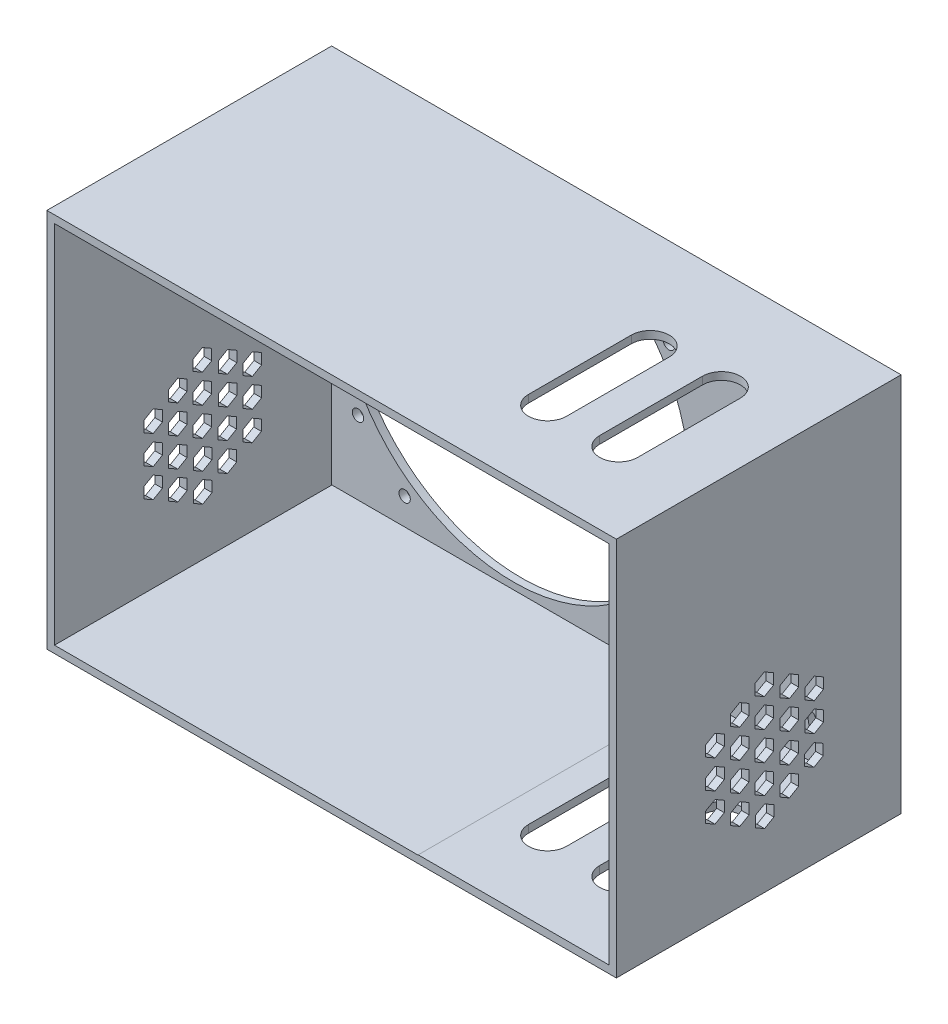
from build123d import *

# Parameters (mm, degrees)
CROQUIS2_W              = 100.387312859
CROQUIS2_H              = 192.201
CROQUIS2_R              = 4.054087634
CROQUIS2_W_2            = 191.612587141
CROQUIS2_R_2            = 3
CROQUIS2_R_3            = 92.5
SALIENTE_EXTRUIR1_DEPTH = 4
CROQUIS2_9_W            = 299.9999
CROQUIS2_9_H            = 200.201
SALIENTE_EXTRUIR3_DEPTH = 150
CORTAR_EXTRUIR1_DEPTH   = 543.825048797
CORTAR_EXTRUIR2_DEPTH   = 399.424962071


with BuildPart() as part:
    # Croquis2 → Saliente-Extruir1 (new body)
    # profile 1 of 2: a face of its own
    with BuildSketch(Plane.XY):
        with Locations((255.906343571, 326.7005)):
            Rectangle(CROQUIS2_W, CROQUIS2_H)
        with BuildLine():
            ThreePointArc((294.90639357, 251.620721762), (296.90639357, 253.620721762), (298.90639357, 251.620721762))
            ThreePointArc((298.90639357, 251.620721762), (281.90639357, 234.620721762), (264.90639357, 251.620721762))
            ThreePointArc((264.90639357, 251.620721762), (266.90639357, 253.620721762), (268.90639357, 251.620721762))
            ThreePointArc((268.90639357, 251.620721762), (281.90639357, 238.620721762), (294.90639357, 251.620721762))
        make_face(mode=Mode.SUBTRACT)
        with Locations((281.90639357, 251.620721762)):
            Circle(CROQUIS2_R, mode=Mode.SUBTRACT)
        with Locations((281.90639357, 326.620721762)):
            Circle(CROQUIS2_R, mode=Mode.SUBTRACT)
        with Locations((281.90639357, 401.620721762)):
            Circle(CROQUIS2_R, mode=Mode.SUBTRACT)
        with BuildLine():
            ThreePointArc((264.90639357, 401.620721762), (281.90639357, 418.620721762), (298.90639357, 401.620721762))
            ThreePointArc((298.90639357, 401.620721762), (298.320607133, 400.206508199), (296.90639357, 399.620721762))
            ThreePointArc((296.90639357, 399.620721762), (295.492180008, 400.206508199), (294.90639357, 401.620721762))
            ThreePointArc((294.90639357, 401.620721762), (281.90639357, 414.620721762), (268.90639357, 401.620721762))
            ThreePointArc((268.90639357, 401.620721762), (268.320607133, 400.206508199), (266.90639357, 399.620721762))
            ThreePointArc((266.90639357, 399.620721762), (265.492180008, 400.206508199), (264.90639357, 401.620721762))
        make_face(mode=Mode.SUBTRACT)
    # profile 2 of 2: a face of its own
    with BuildSketch(Plane.XY):
        with Locations((109.906393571, 326.7005)):
            Rectangle(CROQUIS2_W_2, CROQUIS2_H)
        with Locations((52.548749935, 244.705517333)):
            Circle(CROQUIS2_R_2, mode=Mode.SUBTRACT)
        with Locations((27.991189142, 269.263078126)):
            Circle(CROQUIS2_R_2, mode=Mode.SUBTRACT)
        with Locations((109.90639357, 326.620721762)):
            Circle(CROQUIS2_R_3, mode=Mode.SUBTRACT)
        with Locations((167.264037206, 244.705517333)):
            Circle(CROQUIS2_R_2, mode=Mode.SUBTRACT)
        with Locations((191.821597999, 269.263078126)):
            Circle(CROQUIS2_R_2, mode=Mode.SUBTRACT)
        with Locations((27.991189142, 383.978365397)):
            Circle(CROQUIS2_R_2, mode=Mode.SUBTRACT)
        with Locations((52.548749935, 408.535926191)):
            Circle(CROQUIS2_R_2, mode=Mode.SUBTRACT)
        with Locations((167.264037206, 408.535926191)):
            Circle(CROQUIS2_R_2, mode=Mode.SUBTRACT)
        with Locations((191.821597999, 383.978365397)):
            Circle(CROQUIS2_R_2, mode=Mode.SUBTRACT)
    extrude(amount=SALIENTE_EXTRUIR1_DEPTH)

    # Croquis2_9 → Saliente-Extruir3 (add)
    with BuildSketch(Plane.XY):
        with Locations((160.10005, 326.7005)):
            Rectangle(CROQUIS2_9_W, CROQUIS2_9_H)
        Polygon((205.712687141, 230.6), (205.712687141, 230.440443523), (14.1001, 230.440443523), (14.1001, 230.6), (14.1001, 422.801), (205.712687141, 422.801), (306.1, 422.801), (306.1, 230.6), align=None, mode=Mode.SUBTRACT)
    extrude(amount=SALIENTE_EXTRUIR3_DEPTH)

    # Croquis4 → Cortar-Extruir1 (cut, through all)
    with BuildSketch(Plane(origin=(310.1, 0, 0), x_dir=(0, 0, -1), z_dir=(1, 0, 0))):
        Polygon((-89.847671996, 266.065849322), (-89.847671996, 271.702793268), (-84.965935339, 274.521265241), (-80.084198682, 271.702793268), (-80.084198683, 266.065849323), (-84.965935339, 263.247377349), align=None)
        Polygon((-98.042918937, 282.071265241), (-102.924655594, 279.252793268), (-102.924655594, 273.615849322), (-98.042918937, 270.797377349), (-93.161182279, 273.615849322), (-93.161182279, 279.252793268), align=None)
        Polygon((-98.042918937, 297.171265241), (-102.924655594, 294.352793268), (-102.924655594, 288.715849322), (-98.042918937, 285.897377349), (-93.161182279, 288.715849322), (-93.161182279, 294.352793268), align=None)
        Polygon((-102.924655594, 309.452793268), (-102.924655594, 309.411566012), (-102.924655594, 303.815849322), (-98.042918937, 300.997377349), (-93.161182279, 303.815849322), (-93.16118228, 309.452793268), (-98.042918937, 312.271265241), align=None)
        Polygon((-85.05253788, 319.771265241), (-89.934274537, 316.952793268), (-89.934274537, 311.315849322), (-85.05253788, 308.497377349), (-80.170801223, 311.315849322), (-80.170801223, 316.952793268), align=None)
        Polygon((-85.05253788, 304.671265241), (-89.934274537, 301.852793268), (-89.934274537, 296.215849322), (-85.05253788, 293.397377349), (-80.170801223, 296.215849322), (-80.170801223, 301.852793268), align=None)
        Polygon((-72.062156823, 297.071265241), (-76.94389348, 294.252793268), (-76.94389348, 288.615849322), (-72.062156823, 285.797377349), (-67.180420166, 288.615849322), (-67.180420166, 294.252793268), align=None)
        Polygon((-76.85729094, 273.565849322), (-76.85729094, 279.202793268), (-71.975554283, 282.021265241), (-67.093817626, 279.202793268), (-67.093817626, 273.565849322), (-71.975554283, 270.747377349), align=None)
        Polygon((-76.770688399, 258.515849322), (-71.924655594, 255.717990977), (-67.007215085, 258.557076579), (-67.007215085, 264.152793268), (-71.888951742, 266.971265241), (-76.770688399, 264.152793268), align=None)
        Polygon((-63.780307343, 266.015849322), (-63.780307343, 271.652793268), (-58.898570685, 274.471265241), (-54.016834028, 271.652793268), (-54.016834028, 266.015849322), (-58.898570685, 263.197377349), align=None)
        Polygon((-63.866909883, 281.065849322), (-63.866909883, 286.702793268), (-58.985173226, 289.521265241), (-54.103436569, 286.702793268), (-54.103436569, 281.065849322), (-58.985173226, 278.247377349), align=None)
        Polygon((-50.789926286, 273.515849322), (-50.789926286, 279.152793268), (-45.908189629, 281.971265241), (-41.026452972, 279.152793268), (-41.026452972, 273.515849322), (-45.908189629, 270.697377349), align=None)
        Polygon((-40.888951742, 288.754008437), (-40.888951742, 294.390952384), (-45.770688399, 297.209424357), (-50.652425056, 294.390952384), (-50.652425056, 288.754008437), (-45.770688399, 285.935536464), align=None)
        Polygon((-40.888951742, 309.390952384), (-40.924655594, 309.411566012), (-45.770688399, 312.209424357), (-50.652425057, 309.390952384), (-50.652425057, 303.754008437), (-45.770688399, 300.935536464), (-40.888951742, 303.754008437), align=None)
        Polygon((-53.965935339, 296.304008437), (-53.965935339, 301.940952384), (-58.847671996, 304.759424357), (-63.729408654, 301.940952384), (-63.729408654, 296.304008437), (-58.847671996, 293.485536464), align=None)
        Polygon((-53.965935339, 311.304008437), (-53.965935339, 316.940952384), (-58.847671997, 319.759424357), (-63.729408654, 316.940952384), (-63.729408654, 311.304008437), (-58.847671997, 308.485536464), align=None)
        Polygon((-72.062156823, 312.171265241), (-76.94389348, 309.352793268), (-76.94389348, 303.715849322), (-72.062156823, 300.897377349), (-67.180420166, 303.715849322), (-67.180420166, 309.352793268), align=None)
        Polygon((-72.062156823, 327.271265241), (-76.94389348, 324.452793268), (-76.94389348, 318.815849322), (-72.062156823, 315.997377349), (-67.180420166, 318.815849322), (-67.180420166, 324.452793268), align=None)
        Polygon((-85.05253788, 289.571265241), (-89.934274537, 286.752793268), (-89.934274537, 281.115849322), (-85.05253788, 278.297377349), (-80.170801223, 281.115849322), (-80.170801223, 286.752793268), align=None)
    extrude(amount=-CORTAR_EXTRUIR1_DEPTH, mode=Mode.SUBTRACT)

    # Croquis5 → Cortar-Extruir2 (cut, through all)
    with BuildSketch(Plane(origin=(0, 426.801, 0), x_dir=(1, 0, 0), z_dir=(0, 1, 0))):
        with BuildLine():
            Line((240.902072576, -107.070719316), (240.902072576, -52.936304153))
            ThreePointArc((240.902072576, -52.936304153), (230.902072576, -42.936304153), (220.902072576, -52.936304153))
            Line((220.902072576, -52.936304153), (220.902072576, -107.070719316))
            ThreePointArc((220.902072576, -107.070719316), (230.902072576, -117.070719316), (240.902072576, -107.070719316))
        make_face()
        with BuildLine():
            Line((278.402072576, -107.070719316), (278.402072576, -52.936304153))
            ThreePointArc((278.402072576, -52.936304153), (268.402072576, -42.936304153), (258.402072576, -52.936304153))
            Line((258.402072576, -52.936304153), (258.402072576, -107.070719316))
            ThreePointArc((258.402072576, -107.070719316), (268.402072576, -117.070719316), (278.402072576, -107.070719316))
        make_face()
    extrude(amount=-CORTAR_EXTRUIR2_DEPTH, mode=Mode.SUBTRACT)


solid = part.part
